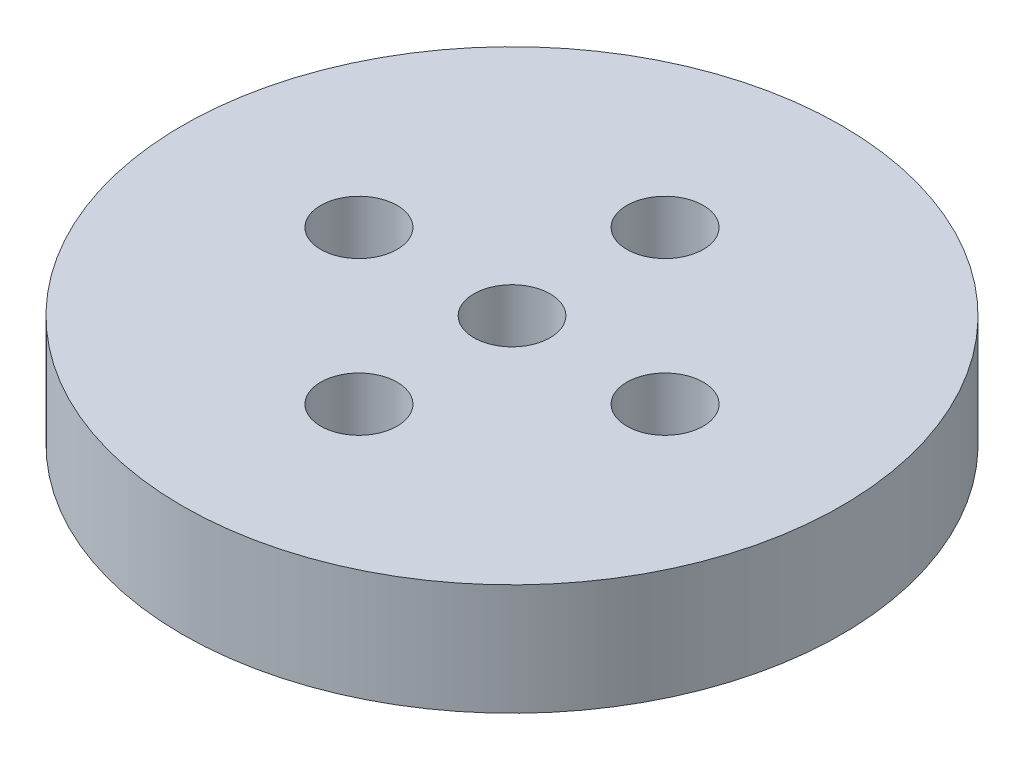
ISO-10303-21;
HEADER;
FILE_DESCRIPTION(('STEP AP214'),'2;1');
FILE_NAME('part.step','',(''),(''),'','','');
FILE_SCHEMA(('AUTOMOTIVE_DESIGN { 1 0 10303 214 1 1 1 1 }'));
ENDSEC;
DATA;
#1=APPLICATION_CONTEXT('core data for automotive mechanical design processes');
#2=APPLICATION_PROTOCOL_DEFINITION('international standard','automotive_design',2000,#1);
#3=PRODUCT_CONTEXT('',#1,'mechanical');
#4=PRODUCT('Part','Part','',(#3));
#5=PRODUCT_RELATED_PRODUCT_CATEGORY('part','',(#4));
#6=PRODUCT_DEFINITION_FORMATION('','',#4);
#7=PRODUCT_DEFINITION_CONTEXT('part definition',#1,'design');
#8=PRODUCT_DEFINITION('design','',#6,#7);
#9=PRODUCT_DEFINITION_SHAPE('','',#8);
#10=(LENGTH_UNIT() NAMED_UNIT(*) SI_UNIT(.MILLI.,.METRE.));
#11=(NAMED_UNIT(*) PLANE_ANGLE_UNIT() SI_UNIT($,.RADIAN.));
#12=(NAMED_UNIT(*) SI_UNIT($,.STERADIAN.) SOLID_ANGLE_UNIT());
#13=UNCERTAINTY_MEASURE_WITH_UNIT(LENGTH_MEASURE(1.E-05),#10,'distance_accuracy_value','');
#14=(GEOMETRIC_REPRESENTATION_CONTEXT(3) GLOBAL_UNCERTAINTY_ASSIGNED_CONTEXT((#13)) GLOBAL_UNIT_ASSIGNED_CONTEXT((#10,
#11,#12)) REPRESENTATION_CONTEXT('',''));
#15=CARTESIAN_POINT('',(0.,0.,0.));
#16=DIRECTION('',(0.,0.,1.));
#17=DIRECTION('',(1.,0.,0.));
#18=AXIS2_PLACEMENT_3D('',#15,#16,#17);
#19=CARTESIAN_POINT('',(0.,5.4,0.));
#20=DIRECTION('',(0.,1.,0.));
#21=DIRECTION('',(0.,0.,1.));
#22=AXIS2_PLACEMENT_3D('',#19,#20,#21);
#23=PLANE('',#22);
#24=CARTESIAN_POINT('',(-1.85110150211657E-13,5.4,7.43169227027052));
#25=DIRECTION('',(0.,1.,0.));
#26=DIRECTION('',(0.,0.,1.));
#27=AXIS2_PLACEMENT_3D('',#24,#25,#26);
#28=CIRCLE('',#27,1.855);
#29=CARTESIAN_POINT('',(-1.85110150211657E-13,5.4,5.57669227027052));
#30=VERTEX_POINT('',#29);
#31=EDGE_CURVE('E61',#30,#30,#28,.T.);
#32=ORIENTED_EDGE('',*,*,#31,.F.);
#33=EDGE_LOOP('',(#32));
#34=FACE_BOUND('',#33,.T.);
#35=CARTESIAN_POINT('',(0.,5.4,-7.43169227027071));
#36=DIRECTION('',(0.,1.,0.));
#37=DIRECTION('',(0.,0.,1.));
#38=AXIS2_PLACEMENT_3D('',#35,#36,#37);
#39=CIRCLE('',#38,1.855);
#40=CARTESIAN_POINT('',(0.,5.4,-9.28669227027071));
#41=VERTEX_POINT('',#40);
#42=EDGE_CURVE('E49',#41,#41,#39,.T.);
#43=ORIENTED_EDGE('',*,*,#42,.F.);
#44=EDGE_LOOP('',(#43));
#45=FACE_BOUND('',#44,.T.);
#46=CARTESIAN_POINT('',(0.,5.4,0.));
#47=DIRECTION('',(0.,1.,0.));
#48=DIRECTION('',(0.,0.,1.));
#49=AXIS2_PLACEMENT_3D('',#46,#47,#48);
#50=CIRCLE('',#49,16.);
#51=CARTESIAN_POINT('',(0.,5.4,-16.));
#52=VERTEX_POINT('',#51);
#53=EDGE_CURVE('E10',#52,#52,#50,.T.);
#54=ORIENTED_EDGE('',*,*,#53,.T.);
#55=EDGE_LOOP('',(#54));
#56=FACE_BOUND('',#55,.T.);
#57=CARTESIAN_POINT('',(0.,5.4,0.));
#58=DIRECTION('',(0.,1.,0.));
#59=DIRECTION('',(0.,0.,1.));
#60=AXIS2_PLACEMENT_3D('',#57,#58,#59);
#61=CIRCLE('',#60,1.85);
#62=CARTESIAN_POINT('',(0.,5.4,-1.85));
#63=VERTEX_POINT('',#62);
#64=EDGE_CURVE('E44',#63,#63,#61,.T.);
#65=ORIENTED_EDGE('',*,*,#64,.F.);
#66=EDGE_LOOP('',(#65));
#67=FACE_BOUND('',#66,.T.);
#68=CARTESIAN_POINT('',(7.43169227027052,5.4,0.));
#69=DIRECTION('',(0.,1.,0.));
#70=DIRECTION('',(0.,0.,1.));
#71=AXIS2_PLACEMENT_3D('',#68,#69,#70);
#72=CIRCLE('',#71,1.855);
#73=CARTESIAN_POINT('',(7.43169227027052,5.4,-1.855));
#74=VERTEX_POINT('',#73);
#75=EDGE_CURVE('E55',#74,#74,#72,.T.);
#76=ORIENTED_EDGE('',*,*,#75,.F.);
#77=EDGE_LOOP('',(#76));
#78=FACE_BOUND('',#77,.T.);
#79=CARTESIAN_POINT('',(-7.43169227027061,5.4,0.));
#80=DIRECTION('',(0.,1.,0.));
#81=DIRECTION('',(0.,0.,1.));
#82=AXIS2_PLACEMENT_3D('',#79,#80,#81);
#83=CIRCLE('',#82,1.85499999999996);
#84=CARTESIAN_POINT('',(-7.43169227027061,5.4,-1.85499999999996));
#85=VERTEX_POINT('',#84);
#86=EDGE_CURVE('E67',#85,#85,#83,.T.);
#87=ORIENTED_EDGE('',*,*,#86,.F.);
#88=EDGE_LOOP('',(#87));
#89=FACE_BOUND('',#88,.T.);
#90=ADVANCED_FACE('F33',(#34,#45,#56,#67,#78,#89),#23,.T.);
#91=CARTESIAN_POINT('',(0.,0.,0.));
#92=DIRECTION('',(0.,1.,0.));
#93=DIRECTION('',(0.,0.,1.));
#94=AXIS2_PLACEMENT_3D('',#91,#92,#93);
#95=PLANE('',#94);
#96=CARTESIAN_POINT('',(0.,0.,0.));
#97=DIRECTION('',(0.,1.,0.));
#98=DIRECTION('',(0.,0.,1.));
#99=AXIS2_PLACEMENT_3D('',#96,#97,#98);
#100=CIRCLE('',#99,16.);
#101=CARTESIAN_POINT('',(0.,0.,-16.));
#102=VERTEX_POINT('',#101);
#103=EDGE_CURVE('E37',#102,#102,#100,.T.);
#104=ORIENTED_EDGE('',*,*,#103,.F.);
#105=EDGE_LOOP('',(#104));
#106=FACE_BOUND('',#105,.T.);
#107=CARTESIAN_POINT('',(0.,0.,0.));
#108=DIRECTION('',(0.,1.,0.));
#109=DIRECTION('',(0.,0.,1.));
#110=AXIS2_PLACEMENT_3D('',#107,#108,#109);
#111=CIRCLE('',#110,1.85);
#112=CARTESIAN_POINT('',(0.,0.,-1.85));
#113=VERTEX_POINT('',#112);
#114=EDGE_CURVE('E46',#113,#113,#111,.T.);
#115=ORIENTED_EDGE('',*,*,#114,.T.);
#116=EDGE_LOOP('',(#115));
#117=FACE_BOUND('',#116,.T.);
#118=CARTESIAN_POINT('',(0.,0.,-7.43169227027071));
#119=DIRECTION('',(0.,1.,0.));
#120=DIRECTION('',(0.,0.,1.));
#121=AXIS2_PLACEMENT_3D('',#118,#119,#120);
#122=CIRCLE('',#121,1.855);
#123=CARTESIAN_POINT('',(0.,0.,-9.28669227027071));
#124=VERTEX_POINT('',#123);
#125=EDGE_CURVE('E52',#124,#124,#122,.T.);
#126=ORIENTED_EDGE('',*,*,#125,.T.);
#127=EDGE_LOOP('',(#126));
#128=FACE_BOUND('',#127,.T.);
#129=CARTESIAN_POINT('',(7.43169227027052,0.,0.));
#130=DIRECTION('',(0.,1.,0.));
#131=DIRECTION('',(0.,0.,1.));
#132=AXIS2_PLACEMENT_3D('',#129,#130,#131);
#133=CIRCLE('',#132,1.855);
#134=CARTESIAN_POINT('',(7.43169227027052,0.,-1.855));
#135=VERTEX_POINT('',#134);
#136=EDGE_CURVE('E58',#135,#135,#133,.T.);
#137=ORIENTED_EDGE('',*,*,#136,.T.);
#138=EDGE_LOOP('',(#137));
#139=FACE_BOUND('',#138,.T.);
#140=CARTESIAN_POINT('',(-1.85110150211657E-13,0.,7.43169227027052));
#141=DIRECTION('',(0.,1.,0.));
#142=DIRECTION('',(0.,0.,1.));
#143=AXIS2_PLACEMENT_3D('',#140,#141,#142);
#144=CIRCLE('',#143,1.855);
#145=CARTESIAN_POINT('',(-1.85110150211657E-13,0.,5.57669227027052));
#146=VERTEX_POINT('',#145);
#147=EDGE_CURVE('E64',#146,#146,#144,.T.);
#148=ORIENTED_EDGE('',*,*,#147,.T.);
#149=EDGE_LOOP('',(#148));
#150=FACE_BOUND('',#149,.T.);
#151=CARTESIAN_POINT('',(-7.43169227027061,0.,0.));
#152=DIRECTION('',(0.,1.,0.));
#153=DIRECTION('',(0.,0.,1.));
#154=AXIS2_PLACEMENT_3D('',#151,#152,#153);
#155=CIRCLE('',#154,1.85499999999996);
#156=CARTESIAN_POINT('',(-7.43169227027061,0.,-1.85499999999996));
#157=VERTEX_POINT('',#156);
#158=EDGE_CURVE('E70',#157,#157,#155,.T.);
#159=ORIENTED_EDGE('',*,*,#158,.T.);
#160=EDGE_LOOP('',(#159));
#161=FACE_BOUND('',#160,.T.);
#162=ADVANCED_FACE('F80',(#106,#117,#128,#139,#150,#161),#95,.F.);
#163=CARTESIAN_POINT('',(0.,5.4,0.));
#164=DIRECTION('',(0.,-1.,0.));
#165=DIRECTION('',(0.,0.,-1.));
#166=AXIS2_PLACEMENT_3D('',#163,#164,#165);
#167=CYLINDRICAL_SURFACE('',#166,16.);
#168=CARTESIAN_POINT('',(0.,5.4,-16.));
#169=CARTESIAN_POINT('',(0.,5.34375,-16.));
#170=CARTESIAN_POINT('',(0.,5.2875,-16.));
#171=CARTESIAN_POINT('',(0.,5.175,-16.));
#172=CARTESIAN_POINT('',(0.,5.11875,-16.));
#173=CARTESIAN_POINT('',(0.,5.00625,-16.));
#174=CARTESIAN_POINT('',(0.,4.95,-16.));
#175=CARTESIAN_POINT('',(0.,4.8375,-16.));
#176=CARTESIAN_POINT('',(0.,4.78125,-16.));
#177=CARTESIAN_POINT('',(0.,4.66875,-16.));
#178=CARTESIAN_POINT('',(0.,4.6125,-16.));
#179=CARTESIAN_POINT('',(0.,4.5,-16.));
#180=CARTESIAN_POINT('',(0.,4.44375,-16.));
#181=CARTESIAN_POINT('',(0.,4.33125,-16.));
#182=CARTESIAN_POINT('',(0.,4.275,-16.));
#183=CARTESIAN_POINT('',(0.,4.1625,-16.));
#184=CARTESIAN_POINT('',(0.,4.10625,-16.));
#185=CARTESIAN_POINT('',(0.,3.99375,-16.));
#186=CARTESIAN_POINT('',(0.,3.9375,-16.));
#187=CARTESIAN_POINT('',(0.,3.825,-16.));
#188=CARTESIAN_POINT('',(0.,3.76875,-16.));
#189=CARTESIAN_POINT('',(0.,3.65625,-16.));
#190=CARTESIAN_POINT('',(0.,3.6,-16.));
#191=CARTESIAN_POINT('',(0.,3.4875,-16.));
#192=CARTESIAN_POINT('',(0.,3.43125,-16.));
#193=CARTESIAN_POINT('',(0.,3.31875,-16.));
#194=CARTESIAN_POINT('',(0.,3.2625,-16.));
#195=CARTESIAN_POINT('',(0.,3.15,-16.));
#196=CARTESIAN_POINT('',(0.,3.09375,-16.));
#197=CARTESIAN_POINT('',(0.,2.98125,-16.));
#198=CARTESIAN_POINT('',(0.,2.925,-16.));
#199=CARTESIAN_POINT('',(0.,2.8125,-16.));
#200=CARTESIAN_POINT('',(0.,2.75625,-16.));
#201=CARTESIAN_POINT('',(0.,2.64375,-16.));
#202=CARTESIAN_POINT('',(0.,2.5875,-16.));
#203=CARTESIAN_POINT('',(0.,2.475,-16.));
#204=CARTESIAN_POINT('',(0.,2.41875,-16.));
#205=CARTESIAN_POINT('',(0.,2.30625,-16.));
#206=CARTESIAN_POINT('',(0.,2.25,-16.));
#207=CARTESIAN_POINT('',(0.,2.1375,-16.));
#208=CARTESIAN_POINT('',(0.,2.08125,-16.));
#209=CARTESIAN_POINT('',(0.,1.96875,-16.));
#210=CARTESIAN_POINT('',(0.,1.9125,-16.));
#211=CARTESIAN_POINT('',(0.,1.8,-16.));
#212=CARTESIAN_POINT('',(0.,1.74375,-16.));
#213=CARTESIAN_POINT('',(0.,1.63125,-16.));
#214=CARTESIAN_POINT('',(0.,1.575,-16.));
#215=CARTESIAN_POINT('',(0.,1.4625,-16.));
#216=CARTESIAN_POINT('',(0.,1.40625,-16.));
#217=CARTESIAN_POINT('',(0.,1.29375,-16.));
#218=CARTESIAN_POINT('',(0.,1.2375,-16.));
#219=CARTESIAN_POINT('',(0.,1.125,-16.));
#220=CARTESIAN_POINT('',(0.,1.06875,-16.));
#221=CARTESIAN_POINT('',(0.,0.956249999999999,-16.));
#222=CARTESIAN_POINT('',(0.,0.899999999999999,-16.));
#223=CARTESIAN_POINT('',(0.,0.787499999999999,-16.));
#224=CARTESIAN_POINT('',(0.,0.731249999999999,-16.));
#225=CARTESIAN_POINT('',(0.,0.618749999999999,-16.));
#226=CARTESIAN_POINT('',(0.,0.562499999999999,-16.));
#227=CARTESIAN_POINT('',(0.,0.449999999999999,-16.));
#228=CARTESIAN_POINT('',(0.,0.393749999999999,-16.));
#229=CARTESIAN_POINT('',(0.,0.281249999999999,-16.));
#230=CARTESIAN_POINT('',(0.,0.224999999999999,-16.));
#231=CARTESIAN_POINT('',(0.,0.112499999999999,-16.));
#232=CARTESIAN_POINT('',(0.,0.0562499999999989,-16.));
#233=CARTESIAN_POINT('',(0.,0.,-16.));
#234=B_SPLINE_CURVE_WITH_KNOTS('',3,(#168,#169,#170,#171,#172,#173,#174,#175,#176,#177,#178,
#179,#180,#181,#182,#183,#184,#185,#186,#187,#188,#189,#190,#191,#192,#193,#194,#195,#196,#197,
#198,#199,#200,#201,#202,#203,#204,#205,#206,#207,#208,#209,#210,#211,#212,#213,#214,#215,#216,
#217,#218,#219,#220,#221,#222,#223,#224,#225,#226,#227,#228,#229,#230,#231,#232,#233),
.UNSPECIFIED.,.F.,.F.,(4,2,2,2,2,2,2,2,2,2,2,2,2,2,2,2,2,2,2,2,2,2,2,2,2,2,2,2,2,2,2,2,4),(0.,
0.16875,0.337499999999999,0.50625,0.674999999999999,0.84375,1.0125,1.18125,1.35,1.51875,1.6875,
1.85625,2.025,2.19375,2.3625,2.53125,2.7,2.86875,3.0375,3.20625,3.375,3.54375,3.7125,3.88125,
4.05,4.21875,4.3875,4.55625,4.725,4.89375,5.0625,5.23125,5.4),.UNSPECIFIED.);
#235=EDGE_CURVE('BSEAM35',#52,#102,#234,.T.);
#236=ORIENTED_EDGE('',*,*,#53,.F.);
#237=ORIENTED_EDGE('',*,*,#103,.T.);
#238=ORIENTED_EDGE('',*,*,#235,.T.);
#239=ORIENTED_EDGE('',*,*,#235,.F.);
#240=EDGE_LOOP('',(#236,#238,#237,#239));
#241=FACE_BOUND('',#240,.T.);
#242=ADVANCED_FACE('F35',(#241),#167,.T.);
#243=CARTESIAN_POINT('',(0.,5.4,0.));
#244=DIRECTION('',(0.,-1.,0.));
#245=DIRECTION('',(0.,0.,-1.));
#246=AXIS2_PLACEMENT_3D('',#243,#244,#245);
#247=CYLINDRICAL_SURFACE('',#246,1.85);
#248=CARTESIAN_POINT('',(0.,5.4,-1.85));
#249=CARTESIAN_POINT('',(0.,5.34375,-1.85));
#250=CARTESIAN_POINT('',(0.,5.2875,-1.85));
#251=CARTESIAN_POINT('',(0.,5.175,-1.85));
#252=CARTESIAN_POINT('',(0.,5.11875,-1.85));
#253=CARTESIAN_POINT('',(0.,5.00625,-1.85));
#254=CARTESIAN_POINT('',(0.,4.95,-1.85));
#255=CARTESIAN_POINT('',(0.,4.8375,-1.85));
#256=CARTESIAN_POINT('',(0.,4.78125,-1.85));
#257=CARTESIAN_POINT('',(0.,4.66875,-1.85));
#258=CARTESIAN_POINT('',(0.,4.6125,-1.85));
#259=CARTESIAN_POINT('',(0.,4.5,-1.85));
#260=CARTESIAN_POINT('',(0.,4.44375,-1.85));
#261=CARTESIAN_POINT('',(0.,4.33125,-1.85));
#262=CARTESIAN_POINT('',(0.,4.275,-1.85));
#263=CARTESIAN_POINT('',(0.,4.1625,-1.85));
#264=CARTESIAN_POINT('',(0.,4.10625,-1.85));
#265=CARTESIAN_POINT('',(0.,3.99375,-1.85));
#266=CARTESIAN_POINT('',(0.,3.9375,-1.85));
#267=CARTESIAN_POINT('',(0.,3.825,-1.85));
#268=CARTESIAN_POINT('',(0.,3.76875,-1.85));
#269=CARTESIAN_POINT('',(0.,3.65625,-1.85));
#270=CARTESIAN_POINT('',(0.,3.6,-1.85));
#271=CARTESIAN_POINT('',(0.,3.4875,-1.85));
#272=CARTESIAN_POINT('',(0.,3.43125,-1.85));
#273=CARTESIAN_POINT('',(0.,3.31875,-1.85));
#274=CARTESIAN_POINT('',(0.,3.2625,-1.85));
#275=CARTESIAN_POINT('',(0.,3.15,-1.85));
#276=CARTESIAN_POINT('',(0.,3.09375,-1.85));
#277=CARTESIAN_POINT('',(0.,2.98125,-1.85));
#278=CARTESIAN_POINT('',(0.,2.925,-1.85));
#279=CARTESIAN_POINT('',(0.,2.8125,-1.85));
#280=CARTESIAN_POINT('',(0.,2.75625,-1.85));
#281=CARTESIAN_POINT('',(0.,2.64375,-1.85));
#282=CARTESIAN_POINT('',(0.,2.5875,-1.85));
#283=CARTESIAN_POINT('',(0.,2.475,-1.85));
#284=CARTESIAN_POINT('',(0.,2.41875,-1.85));
#285=CARTESIAN_POINT('',(0.,2.30625,-1.85));
#286=CARTESIAN_POINT('',(0.,2.25,-1.85));
#287=CARTESIAN_POINT('',(0.,2.1375,-1.85));
#288=CARTESIAN_POINT('',(0.,2.08125,-1.85));
#289=CARTESIAN_POINT('',(0.,1.96875,-1.85));
#290=CARTESIAN_POINT('',(0.,1.9125,-1.85));
#291=CARTESIAN_POINT('',(0.,1.8,-1.85));
#292=CARTESIAN_POINT('',(0.,1.74375,-1.85));
#293=CARTESIAN_POINT('',(0.,1.63125,-1.85));
#294=CARTESIAN_POINT('',(0.,1.575,-1.85));
#295=CARTESIAN_POINT('',(0.,1.4625,-1.85));
#296=CARTESIAN_POINT('',(0.,1.40625,-1.85));
#297=CARTESIAN_POINT('',(0.,1.29375,-1.85));
#298=CARTESIAN_POINT('',(0.,1.2375,-1.85));
#299=CARTESIAN_POINT('',(0.,1.125,-1.85));
#300=CARTESIAN_POINT('',(0.,1.06875,-1.85));
#301=CARTESIAN_POINT('',(0.,0.956249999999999,-1.85));
#302=CARTESIAN_POINT('',(0.,0.899999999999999,-1.85));
#303=CARTESIAN_POINT('',(0.,0.787499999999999,-1.85));
#304=CARTESIAN_POINT('',(0.,0.731249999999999,-1.85));
#305=CARTESIAN_POINT('',(0.,0.618749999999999,-1.85));
#306=CARTESIAN_POINT('',(0.,0.562499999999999,-1.85));
#307=CARTESIAN_POINT('',(0.,0.449999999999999,-1.85));
#308=CARTESIAN_POINT('',(0.,0.393749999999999,-1.85));
#309=CARTESIAN_POINT('',(0.,0.281249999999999,-1.85));
#310=CARTESIAN_POINT('',(0.,0.224999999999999,-1.85));
#311=CARTESIAN_POINT('',(0.,0.112499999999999,-1.85));
#312=CARTESIAN_POINT('',(0.,0.0562499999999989,-1.85));
#313=CARTESIAN_POINT('',(0.,0.,-1.85));
#314=B_SPLINE_CURVE_WITH_KNOTS('',3,(#248,#249,#250,#251,#252,#253,#254,#255,#256,#257,#258,
#259,#260,#261,#262,#263,#264,#265,#266,#267,#268,#269,#270,#271,#272,#273,#274,#275,#276,#277,
#278,#279,#280,#281,#282,#283,#284,#285,#286,#287,#288,#289,#290,#291,#292,#293,#294,#295,#296,
#297,#298,#299,#300,#301,#302,#303,#304,#305,#306,#307,#308,#309,#310,#311,#312,#313),
.UNSPECIFIED.,.F.,.F.,(4,2,2,2,2,2,2,2,2,2,2,2,2,2,2,2,2,2,2,2,2,2,2,2,2,2,2,2,2,2,2,2,4),(0.,
0.16875,0.337499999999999,0.50625,0.674999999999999,0.84375,1.0125,1.18125,1.35,1.51875,1.6875,
1.85625,2.025,2.19375,2.3625,2.53125,2.7,2.86875,3.0375,3.20625,3.375,3.54375,3.7125,3.88125,
4.05,4.21875,4.3875,4.55625,4.725,4.89375,5.0625,5.23125,5.4),.UNSPECIFIED.);
#315=EDGE_CURVE('BSEAM90',#63,#113,#314,.T.);
#316=ORIENTED_EDGE('',*,*,#64,.T.);
#317=ORIENTED_EDGE('',*,*,#114,.F.);
#318=ORIENTED_EDGE('',*,*,#315,.T.);
#319=ORIENTED_EDGE('',*,*,#315,.F.);
#320=EDGE_LOOP('',(#316,#318,#317,#319));
#321=FACE_BOUND('',#320,.T.);
#322=ADVANCED_FACE('F90',(#321),#247,.F.);
#323=CARTESIAN_POINT('',(0.,5.4,-7.43169227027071));
#324=DIRECTION('',(0.,-1.,0.));
#325=DIRECTION('',(0.,0.,-1.));
#326=AXIS2_PLACEMENT_3D('',#323,#324,#325);
#327=CYLINDRICAL_SURFACE('',#326,1.855);
#328=CARTESIAN_POINT('',(0.,5.4,-9.28669227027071));
#329=CARTESIAN_POINT('',(0.,5.34375,-9.28669227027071));
#330=CARTESIAN_POINT('',(0.,5.2875,-9.28669227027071));
#331=CARTESIAN_POINT('',(0.,5.175,-9.28669227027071));
#332=CARTESIAN_POINT('',(0.,5.11875,-9.28669227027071));
#333=CARTESIAN_POINT('',(0.,5.00625,-9.28669227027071));
#334=CARTESIAN_POINT('',(0.,4.95,-9.28669227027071));
#335=CARTESIAN_POINT('',(0.,4.8375,-9.28669227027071));
#336=CARTESIAN_POINT('',(0.,4.78125,-9.28669227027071));
#337=CARTESIAN_POINT('',(0.,4.66875,-9.28669227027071));
#338=CARTESIAN_POINT('',(0.,4.6125,-9.28669227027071));
#339=CARTESIAN_POINT('',(0.,4.5,-9.28669227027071));
#340=CARTESIAN_POINT('',(0.,4.44375,-9.28669227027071));
#341=CARTESIAN_POINT('',(0.,4.33125,-9.28669227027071));
#342=CARTESIAN_POINT('',(0.,4.275,-9.28669227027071));
#343=CARTESIAN_POINT('',(0.,4.1625,-9.28669227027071));
#344=CARTESIAN_POINT('',(0.,4.10625,-9.28669227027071));
#345=CARTESIAN_POINT('',(0.,3.99375,-9.28669227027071));
#346=CARTESIAN_POINT('',(0.,3.9375,-9.28669227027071));
#347=CARTESIAN_POINT('',(0.,3.825,-9.28669227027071));
#348=CARTESIAN_POINT('',(0.,3.76875,-9.28669227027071));
#349=CARTESIAN_POINT('',(0.,3.65625,-9.28669227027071));
#350=CARTESIAN_POINT('',(0.,3.6,-9.28669227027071));
#351=CARTESIAN_POINT('',(0.,3.4875,-9.28669227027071));
#352=CARTESIAN_POINT('',(0.,3.43125,-9.28669227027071));
#353=CARTESIAN_POINT('',(0.,3.31875,-9.28669227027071));
#354=CARTESIAN_POINT('',(0.,3.2625,-9.28669227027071));
#355=CARTESIAN_POINT('',(0.,3.15,-9.28669227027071));
#356=CARTESIAN_POINT('',(0.,3.09375,-9.28669227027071));
#357=CARTESIAN_POINT('',(0.,2.98125,-9.28669227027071));
#358=CARTESIAN_POINT('',(0.,2.925,-9.28669227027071));
#359=CARTESIAN_POINT('',(0.,2.8125,-9.28669227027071));
#360=CARTESIAN_POINT('',(0.,2.75625,-9.28669227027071));
#361=CARTESIAN_POINT('',(0.,2.64375,-9.28669227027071));
#362=CARTESIAN_POINT('',(0.,2.5875,-9.28669227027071));
#363=CARTESIAN_POINT('',(0.,2.475,-9.28669227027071));
#364=CARTESIAN_POINT('',(0.,2.41875,-9.28669227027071));
#365=CARTESIAN_POINT('',(0.,2.30625,-9.28669227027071));
#366=CARTESIAN_POINT('',(0.,2.25,-9.28669227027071));
#367=CARTESIAN_POINT('',(0.,2.1375,-9.28669227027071));
#368=CARTESIAN_POINT('',(0.,2.08125,-9.28669227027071));
#369=CARTESIAN_POINT('',(0.,1.96875,-9.28669227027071));
#370=CARTESIAN_POINT('',(0.,1.9125,-9.28669227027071));
#371=CARTESIAN_POINT('',(0.,1.8,-9.28669227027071));
#372=CARTESIAN_POINT('',(0.,1.74375,-9.28669227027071));
#373=CARTESIAN_POINT('',(0.,1.63125,-9.28669227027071));
#374=CARTESIAN_POINT('',(0.,1.575,-9.28669227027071));
#375=CARTESIAN_POINT('',(0.,1.4625,-9.28669227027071));
#376=CARTESIAN_POINT('',(0.,1.40625,-9.28669227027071));
#377=CARTESIAN_POINT('',(0.,1.29375,-9.28669227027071));
#378=CARTESIAN_POINT('',(0.,1.2375,-9.28669227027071));
#379=CARTESIAN_POINT('',(0.,1.125,-9.28669227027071));
#380=CARTESIAN_POINT('',(0.,1.06875,-9.28669227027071));
#381=CARTESIAN_POINT('',(0.,0.95625,-9.28669227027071));
#382=CARTESIAN_POINT('',(0.,0.9,-9.28669227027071));
#383=CARTESIAN_POINT('',(0.,0.7875,-9.28669227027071));
#384=CARTESIAN_POINT('',(0.,0.73125,-9.28669227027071));
#385=CARTESIAN_POINT('',(0.,0.618749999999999,-9.28669227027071));
#386=CARTESIAN_POINT('',(0.,0.562499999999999,-9.28669227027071));
#387=CARTESIAN_POINT('',(0.,0.449999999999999,-9.28669227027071));
#388=CARTESIAN_POINT('',(0.,0.393749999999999,-9.28669227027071));
#389=CARTESIAN_POINT('',(0.,0.281249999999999,-9.28669227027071));
#390=CARTESIAN_POINT('',(0.,0.225,-9.28669227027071));
#391=CARTESIAN_POINT('',(0.,0.112499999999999,-9.28669227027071));
#392=CARTESIAN_POINT('',(0.,0.0562499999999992,-9.28669227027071));
#393=CARTESIAN_POINT('',(0.,0.,-9.28669227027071));
#394=B_SPLINE_CURVE_WITH_KNOTS('',3,(#328,#329,#330,#331,#332,#333,#334,#335,#336,#337,#338,
#339,#340,#341,#342,#343,#344,#345,#346,#347,#348,#349,#350,#351,#352,#353,#354,#355,#356,#357,
#358,#359,#360,#361,#362,#363,#364,#365,#366,#367,#368,#369,#370,#371,#372,#373,#374,#375,#376,
#377,#378,#379,#380,#381,#382,#383,#384,#385,#386,#387,#388,#389,#390,#391,#392,#393),
.UNSPECIFIED.,.F.,.F.,(4,2,2,2,2,2,2,2,2,2,2,2,2,2,2,2,2,2,2,2,2,2,2,2,2,2,2,2,2,2,2,2,4),(0.,
0.168750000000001,0.3375,0.506250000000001,0.675,0.843750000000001,1.0125,1.18125,1.35,1.51875,
1.6875,1.85625,2.025,2.19375,2.3625,2.53125,2.7,2.86875,3.0375,3.20625,3.375,3.54375,3.7125,
3.88125,4.05,4.21875,4.3875,4.55625,4.725,4.89375,5.0625,5.23125,5.4),.UNSPECIFIED.);
#395=EDGE_CURVE('BSEAM93',#41,#124,#394,.T.);
#396=ORIENTED_EDGE('',*,*,#42,.T.);
#397=ORIENTED_EDGE('',*,*,#125,.F.);
#398=ORIENTED_EDGE('',*,*,#395,.T.);
#399=ORIENTED_EDGE('',*,*,#395,.F.);
#400=EDGE_LOOP('',(#396,#398,#397,#399));
#401=FACE_BOUND('',#400,.T.);
#402=ADVANCED_FACE('F93',(#401),#327,.F.);
#403=CARTESIAN_POINT('',(7.43169227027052,5.4,0.));
#404=DIRECTION('',(0.,-1.,0.));
#405=DIRECTION('',(0.,0.,-1.));
#406=AXIS2_PLACEMENT_3D('',#403,#404,#405);
#407=CYLINDRICAL_SURFACE('',#406,1.855);
#408=CARTESIAN_POINT('',(7.43169227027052,5.4,-1.855));
#409=CARTESIAN_POINT('',(7.43169227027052,5.34375,-1.855));
#410=CARTESIAN_POINT('',(7.43169227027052,5.2875,-1.855));
#411=CARTESIAN_POINT('',(7.43169227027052,5.175,-1.855));
#412=CARTESIAN_POINT('',(7.43169227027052,5.11875,-1.855));
#413=CARTESIAN_POINT('',(7.43169227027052,5.00625,-1.855));
#414=CARTESIAN_POINT('',(7.43169227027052,4.95,-1.855));
#415=CARTESIAN_POINT('',(7.43169227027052,4.8375,-1.855));
#416=CARTESIAN_POINT('',(7.43169227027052,4.78125,-1.855));
#417=CARTESIAN_POINT('',(7.43169227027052,4.66875,-1.855));
#418=CARTESIAN_POINT('',(7.43169227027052,4.6125,-1.855));
#419=CARTESIAN_POINT('',(7.43169227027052,4.5,-1.855));
#420=CARTESIAN_POINT('',(7.43169227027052,4.44375,-1.855));
#421=CARTESIAN_POINT('',(7.43169227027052,4.33125,-1.855));
#422=CARTESIAN_POINT('',(7.43169227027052,4.275,-1.855));
#423=CARTESIAN_POINT('',(7.43169227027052,4.1625,-1.855));
#424=CARTESIAN_POINT('',(7.43169227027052,4.10625,-1.855));
#425=CARTESIAN_POINT('',(7.43169227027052,3.99375,-1.855));
#426=CARTESIAN_POINT('',(7.43169227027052,3.9375,-1.855));
#427=CARTESIAN_POINT('',(7.43169227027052,3.825,-1.855));
#428=CARTESIAN_POINT('',(7.43169227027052,3.76875,-1.855));
#429=CARTESIAN_POINT('',(7.43169227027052,3.65625,-1.855));
#430=CARTESIAN_POINT('',(7.43169227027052,3.6,-1.855));
#431=CARTESIAN_POINT('',(7.43169227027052,3.4875,-1.855));
#432=CARTESIAN_POINT('',(7.43169227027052,3.43125,-1.855));
#433=CARTESIAN_POINT('',(7.43169227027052,3.31875,-1.855));
#434=CARTESIAN_POINT('',(7.43169227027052,3.2625,-1.855));
#435=CARTESIAN_POINT('',(7.43169227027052,3.15,-1.855));
#436=CARTESIAN_POINT('',(7.43169227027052,3.09375,-1.855));
#437=CARTESIAN_POINT('',(7.43169227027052,2.98125,-1.855));
#438=CARTESIAN_POINT('',(7.43169227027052,2.925,-1.855));
#439=CARTESIAN_POINT('',(7.43169227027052,2.8125,-1.855));
#440=CARTESIAN_POINT('',(7.43169227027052,2.75625,-1.855));
#441=CARTESIAN_POINT('',(7.43169227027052,2.64375,-1.855));
#442=CARTESIAN_POINT('',(7.43169227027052,2.5875,-1.855));
#443=CARTESIAN_POINT('',(7.43169227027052,2.475,-1.855));
#444=CARTESIAN_POINT('',(7.43169227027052,2.41875,-1.855));
#445=CARTESIAN_POINT('',(7.43169227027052,2.30625,-1.855));
#446=CARTESIAN_POINT('',(7.43169227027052,2.25,-1.855));
#447=CARTESIAN_POINT('',(7.43169227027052,2.1375,-1.855));
#448=CARTESIAN_POINT('',(7.43169227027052,2.08125,-1.855));
#449=CARTESIAN_POINT('',(7.43169227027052,1.96875,-1.855));
#450=CARTESIAN_POINT('',(7.43169227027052,1.9125,-1.855));
#451=CARTESIAN_POINT('',(7.43169227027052,1.8,-1.855));
#452=CARTESIAN_POINT('',(7.43169227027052,1.74375,-1.855));
#453=CARTESIAN_POINT('',(7.43169227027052,1.63125,-1.855));
#454=CARTESIAN_POINT('',(7.43169227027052,1.575,-1.855));
#455=CARTESIAN_POINT('',(7.43169227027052,1.4625,-1.855));
#456=CARTESIAN_POINT('',(7.43169227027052,1.40625,-1.855));
#457=CARTESIAN_POINT('',(7.43169227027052,1.29375,-1.855));
#458=CARTESIAN_POINT('',(7.43169227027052,1.2375,-1.855));
#459=CARTESIAN_POINT('',(7.43169227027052,1.125,-1.855));
#460=CARTESIAN_POINT('',(7.43169227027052,1.06875,-1.855));
#461=CARTESIAN_POINT('',(7.43169227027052,0.95625,-1.855));
#462=CARTESIAN_POINT('',(7.43169227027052,0.9,-1.855));
#463=CARTESIAN_POINT('',(7.43169227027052,0.7875,-1.855));
#464=CARTESIAN_POINT('',(7.43169227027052,0.73125,-1.855));
#465=CARTESIAN_POINT('',(7.43169227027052,0.618749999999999,-1.855));
#466=CARTESIAN_POINT('',(7.43169227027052,0.562499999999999,-1.855));
#467=CARTESIAN_POINT('',(7.43169227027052,0.449999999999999,-1.855));
#468=CARTESIAN_POINT('',(7.43169227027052,0.393749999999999,-1.855));
#469=CARTESIAN_POINT('',(7.43169227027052,0.281249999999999,-1.855));
#470=CARTESIAN_POINT('',(7.43169227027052,0.225,-1.855));
#471=CARTESIAN_POINT('',(7.43169227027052,0.112499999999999,-1.855));
#472=CARTESIAN_POINT('',(7.43169227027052,0.0562499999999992,-1.855));
#473=CARTESIAN_POINT('',(7.43169227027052,0.,-1.855));
#474=B_SPLINE_CURVE_WITH_KNOTS('',3,(#408,#409,#410,#411,#412,#413,#414,#415,#416,#417,#418,
#419,#420,#421,#422,#423,#424,#425,#426,#427,#428,#429,#430,#431,#432,#433,#434,#435,#436,#437,
#438,#439,#440,#441,#442,#443,#444,#445,#446,#447,#448,#449,#450,#451,#452,#453,#454,#455,#456,
#457,#458,#459,#460,#461,#462,#463,#464,#465,#466,#467,#468,#469,#470,#471,#472,#473),
.UNSPECIFIED.,.F.,.F.,(4,2,2,2,2,2,2,2,2,2,2,2,2,2,2,2,2,2,2,2,2,2,2,2,2,2,2,2,2,2,2,2,4),(0.,
0.168750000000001,0.3375,0.506250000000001,0.675,0.843750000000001,1.0125,1.18125,1.35,1.51875,
1.6875,1.85625,2.025,2.19375,2.3625,2.53125,2.7,2.86875,3.0375,3.20625,3.375,3.54375,3.7125,
3.88125,4.05,4.21875,4.3875,4.55625,4.725,4.89375,5.0625,5.23125,5.4),.UNSPECIFIED.);
#475=EDGE_CURVE('BSEAM97',#74,#135,#474,.T.);
#476=ORIENTED_EDGE('',*,*,#75,.T.);
#477=ORIENTED_EDGE('',*,*,#136,.F.);
#478=ORIENTED_EDGE('',*,*,#475,.T.);
#479=ORIENTED_EDGE('',*,*,#475,.F.);
#480=EDGE_LOOP('',(#476,#478,#477,#479));
#481=FACE_BOUND('',#480,.T.);
#482=ADVANCED_FACE('F97',(#481),#407,.F.);
#483=CARTESIAN_POINT('',(-1.85110150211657E-13,5.4,7.43169227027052));
#484=DIRECTION('',(0.,-1.,0.));
#485=DIRECTION('',(0.,0.,-1.));
#486=AXIS2_PLACEMENT_3D('',#483,#484,#485);
#487=CYLINDRICAL_SURFACE('',#486,1.855);
#488=CARTESIAN_POINT('',(-1.85110150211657E-13,5.4,5.57669227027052));
#489=CARTESIAN_POINT('',(-1.85110150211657E-13,5.34375,5.57669227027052));
#490=CARTESIAN_POINT('',(-1.85110150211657E-13,5.2875,5.57669227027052));
#491=CARTESIAN_POINT('',(-1.85110150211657E-13,5.175,5.57669227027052));
#492=CARTESIAN_POINT('',(-1.85110150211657E-13,5.11875,5.57669227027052));
#493=CARTESIAN_POINT('',(-1.85110150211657E-13,5.00625,5.57669227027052));
#494=CARTESIAN_POINT('',(-1.85110150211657E-13,4.95,5.57669227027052));
#495=CARTESIAN_POINT('',(-1.85110150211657E-13,4.8375,5.57669227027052));
#496=CARTESIAN_POINT('',(-1.85110150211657E-13,4.78125,5.57669227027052));
#497=CARTESIAN_POINT('',(-1.85110150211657E-13,4.66875,5.57669227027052));
#498=CARTESIAN_POINT('',(-1.85110150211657E-13,4.6125,5.57669227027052));
#499=CARTESIAN_POINT('',(-1.85110150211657E-13,4.5,5.57669227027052));
#500=CARTESIAN_POINT('',(-1.85110150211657E-13,4.44375,5.57669227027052));
#501=CARTESIAN_POINT('',(-1.85110150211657E-13,4.33125,5.57669227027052));
#502=CARTESIAN_POINT('',(-1.85110150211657E-13,4.275,5.57669227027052));
#503=CARTESIAN_POINT('',(-1.85110150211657E-13,4.1625,5.57669227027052));
#504=CARTESIAN_POINT('',(-1.85110150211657E-13,4.10625,5.57669227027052));
#505=CARTESIAN_POINT('',(-1.85110150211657E-13,3.99375,5.57669227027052));
#506=CARTESIAN_POINT('',(-1.85110150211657E-13,3.9375,5.57669227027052));
#507=CARTESIAN_POINT('',(-1.85110150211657E-13,3.825,5.57669227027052));
#508=CARTESIAN_POINT('',(-1.85110150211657E-13,3.76875,5.57669227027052));
#509=CARTESIAN_POINT('',(-1.85110150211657E-13,3.65625,5.57669227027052));
#510=CARTESIAN_POINT('',(-1.85110150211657E-13,3.6,5.57669227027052));
#511=CARTESIAN_POINT('',(-1.85110150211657E-13,3.4875,5.57669227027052));
#512=CARTESIAN_POINT('',(-1.85110150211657E-13,3.43125,5.57669227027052));
#513=CARTESIAN_POINT('',(-1.85110150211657E-13,3.31875,5.57669227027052));
#514=CARTESIAN_POINT('',(-1.85110150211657E-13,3.2625,5.57669227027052));
#515=CARTESIAN_POINT('',(-1.85110150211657E-13,3.15,5.57669227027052));
#516=CARTESIAN_POINT('',(-1.85110150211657E-13,3.09375,5.57669227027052));
#517=CARTESIAN_POINT('',(-1.85110150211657E-13,2.98125,5.57669227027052));
#518=CARTESIAN_POINT('',(-1.85110150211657E-13,2.925,5.57669227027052));
#519=CARTESIAN_POINT('',(-1.85110150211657E-13,2.8125,5.57669227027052));
#520=CARTESIAN_POINT('',(-1.85110150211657E-13,2.75625,5.57669227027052));
#521=CARTESIAN_POINT('',(-1.85110150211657E-13,2.64375,5.57669227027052));
#522=CARTESIAN_POINT('',(-1.85110150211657E-13,2.5875,5.57669227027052));
#523=CARTESIAN_POINT('',(-1.85110150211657E-13,2.475,5.57669227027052));
#524=CARTESIAN_POINT('',(-1.85110150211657E-13,2.41875,5.57669227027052));
#525=CARTESIAN_POINT('',(-1.85110150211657E-13,2.30625,5.57669227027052));
#526=CARTESIAN_POINT('',(-1.85110150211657E-13,2.25,5.57669227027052));
#527=CARTESIAN_POINT('',(-1.85110150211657E-13,2.1375,5.57669227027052));
#528=CARTESIAN_POINT('',(-1.85110150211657E-13,2.08125,5.57669227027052));
#529=CARTESIAN_POINT('',(-1.85110150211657E-13,1.96875,5.57669227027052));
#530=CARTESIAN_POINT('',(-1.85110150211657E-13,1.9125,5.57669227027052));
#531=CARTESIAN_POINT('',(-1.85110150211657E-13,1.8,5.57669227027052));
#532=CARTESIAN_POINT('',(-1.85110150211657E-13,1.74375,5.57669227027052));
#533=CARTESIAN_POINT('',(-1.85110150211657E-13,1.63125,5.57669227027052));
#534=CARTESIAN_POINT('',(-1.85110150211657E-13,1.575,5.57669227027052));
#535=CARTESIAN_POINT('',(-1.85110150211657E-13,1.4625,5.57669227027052));
#536=CARTESIAN_POINT('',(-1.85110150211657E-13,1.40625,5.57669227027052));
#537=CARTESIAN_POINT('',(-1.85110150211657E-13,1.29375,5.57669227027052));
#538=CARTESIAN_POINT('',(-1.85110150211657E-13,1.2375,5.57669227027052));
#539=CARTESIAN_POINT('',(-1.85110150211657E-13,1.125,5.57669227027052));
#540=CARTESIAN_POINT('',(-1.85110150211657E-13,1.06875,5.57669227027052));
#541=CARTESIAN_POINT('',(-1.85110150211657E-13,0.95625,5.57669227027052));
#542=CARTESIAN_POINT('',(-1.85110150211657E-13,0.9,5.57669227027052));
#543=CARTESIAN_POINT('',(-1.85110150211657E-13,0.7875,5.57669227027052));
#544=CARTESIAN_POINT('',(-1.85110150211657E-13,0.73125,5.57669227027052));
#545=CARTESIAN_POINT('',(-1.85110150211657E-13,0.618749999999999,5.57669227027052));
#546=CARTESIAN_POINT('',(-1.85110150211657E-13,0.562499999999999,5.57669227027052));
#547=CARTESIAN_POINT('',(-1.85110150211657E-13,0.449999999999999,5.57669227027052));
#548=CARTESIAN_POINT('',(-1.85110150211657E-13,0.393749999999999,5.57669227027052));
#549=CARTESIAN_POINT('',(-1.85110150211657E-13,0.281249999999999,5.57669227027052));
#550=CARTESIAN_POINT('',(-1.85110150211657E-13,0.225,5.57669227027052));
#551=CARTESIAN_POINT('',(-1.85110150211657E-13,0.112499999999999,5.57669227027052));
#552=CARTESIAN_POINT('',(-1.85110150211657E-13,0.0562499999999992,5.57669227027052));
#553=CARTESIAN_POINT('',(-1.85110150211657E-13,0.,5.57669227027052));
#554=B_SPLINE_CURVE_WITH_KNOTS('',3,(#488,#489,#490,#491,#492,#493,#494,#495,#496,#497,#498,
#499,#500,#501,#502,#503,#504,#505,#506,#507,#508,#509,#510,#511,#512,#513,#514,#515,#516,#517,
#518,#519,#520,#521,#522,#523,#524,#525,#526,#527,#528,#529,#530,#531,#532,#533,#534,#535,#536,
#537,#538,#539,#540,#541,#542,#543,#544,#545,#546,#547,#548,#549,#550,#551,#552,#553),
.UNSPECIFIED.,.F.,.F.,(4,2,2,2,2,2,2,2,2,2,2,2,2,2,2,2,2,2,2,2,2,2,2,2,2,2,2,2,2,2,2,2,4),(0.,
0.168750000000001,0.3375,0.506250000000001,0.675,0.843750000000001,1.0125,1.18125,1.35,1.51875,
1.6875,1.85625,2.025,2.19375,2.3625,2.53125,2.7,2.86875,3.0375,3.20625,3.375,3.54375,3.7125,
3.88125,4.05,4.21875,4.3875,4.55625,4.725,4.89375,5.0625,5.23125,5.4),.UNSPECIFIED.);
#555=EDGE_CURVE('BSEAM101',#30,#146,#554,.T.);
#556=ORIENTED_EDGE('',*,*,#31,.T.);
#557=ORIENTED_EDGE('',*,*,#147,.F.);
#558=ORIENTED_EDGE('',*,*,#555,.T.);
#559=ORIENTED_EDGE('',*,*,#555,.F.);
#560=EDGE_LOOP('',(#556,#558,#557,#559));
#561=FACE_BOUND('',#560,.T.);
#562=ADVANCED_FACE('F101',(#561),#487,.F.);
#563=CARTESIAN_POINT('',(-7.43169227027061,5.4,0.));
#564=DIRECTION('',(0.,-1.,0.));
#565=DIRECTION('',(0.,0.,-1.));
#566=AXIS2_PLACEMENT_3D('',#563,#564,#565);
#567=CYLINDRICAL_SURFACE('',#566,1.85499999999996);
#568=CARTESIAN_POINT('',(-7.43169227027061,5.4,-1.85499999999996));
#569=CARTESIAN_POINT('',(-7.43169227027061,5.34375,-1.85499999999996));
#570=CARTESIAN_POINT('',(-7.43169227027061,5.2875,-1.85499999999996));
#571=CARTESIAN_POINT('',(-7.43169227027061,5.175,-1.85499999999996));
#572=CARTESIAN_POINT('',(-7.43169227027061,5.11875,-1.85499999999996));
#573=CARTESIAN_POINT('',(-7.43169227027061,5.00625,-1.85499999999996));
#574=CARTESIAN_POINT('',(-7.43169227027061,4.95,-1.85499999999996));
#575=CARTESIAN_POINT('',(-7.43169227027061,4.8375,-1.85499999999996));
#576=CARTESIAN_POINT('',(-7.43169227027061,4.78125,-1.85499999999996));
#577=CARTESIAN_POINT('',(-7.43169227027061,4.66875,-1.85499999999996));
#578=CARTESIAN_POINT('',(-7.43169227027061,4.6125,-1.85499999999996));
#579=CARTESIAN_POINT('',(-7.43169227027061,4.5,-1.85499999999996));
#580=CARTESIAN_POINT('',(-7.43169227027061,4.44375,-1.85499999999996));
#581=CARTESIAN_POINT('',(-7.43169227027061,4.33125,-1.85499999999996));
#582=CARTESIAN_POINT('',(-7.43169227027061,4.275,-1.85499999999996));
#583=CARTESIAN_POINT('',(-7.43169227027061,4.1625,-1.85499999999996));
#584=CARTESIAN_POINT('',(-7.43169227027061,4.10625,-1.85499999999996));
#585=CARTESIAN_POINT('',(-7.43169227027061,3.99375,-1.85499999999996));
#586=CARTESIAN_POINT('',(-7.43169227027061,3.9375,-1.85499999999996));
#587=CARTESIAN_POINT('',(-7.43169227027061,3.825,-1.85499999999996));
#588=CARTESIAN_POINT('',(-7.43169227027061,3.76875,-1.85499999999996));
#589=CARTESIAN_POINT('',(-7.43169227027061,3.65625,-1.85499999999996));
#590=CARTESIAN_POINT('',(-7.43169227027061,3.6,-1.85499999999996));
#591=CARTESIAN_POINT('',(-7.43169227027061,3.4875,-1.85499999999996));
#592=CARTESIAN_POINT('',(-7.43169227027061,3.43125,-1.85499999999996));
#593=CARTESIAN_POINT('',(-7.43169227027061,3.31875,-1.85499999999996));
#594=CARTESIAN_POINT('',(-7.43169227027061,3.2625,-1.85499999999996));
#595=CARTESIAN_POINT('',(-7.43169227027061,3.15,-1.85499999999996));
#596=CARTESIAN_POINT('',(-7.43169227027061,3.09375,-1.85499999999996));
#597=CARTESIAN_POINT('',(-7.43169227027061,2.98125,-1.85499999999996));
#598=CARTESIAN_POINT('',(-7.43169227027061,2.925,-1.85499999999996));
#599=CARTESIAN_POINT('',(-7.43169227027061,2.8125,-1.85499999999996));
#600=CARTESIAN_POINT('',(-7.43169227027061,2.75625,-1.85499999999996));
#601=CARTESIAN_POINT('',(-7.43169227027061,2.64375,-1.85499999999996));
#602=CARTESIAN_POINT('',(-7.43169227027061,2.5875,-1.85499999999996));
#603=CARTESIAN_POINT('',(-7.43169227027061,2.475,-1.85499999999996));
#604=CARTESIAN_POINT('',(-7.43169227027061,2.41875,-1.85499999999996));
#605=CARTESIAN_POINT('',(-7.43169227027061,2.30625,-1.85499999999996));
#606=CARTESIAN_POINT('',(-7.43169227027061,2.25,-1.85499999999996));
#607=CARTESIAN_POINT('',(-7.43169227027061,2.1375,-1.85499999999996));
#608=CARTESIAN_POINT('',(-7.43169227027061,2.08125,-1.85499999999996));
#609=CARTESIAN_POINT('',(-7.43169227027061,1.96875,-1.85499999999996));
#610=CARTESIAN_POINT('',(-7.43169227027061,1.9125,-1.85499999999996));
#611=CARTESIAN_POINT('',(-7.43169227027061,1.8,-1.85499999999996));
#612=CARTESIAN_POINT('',(-7.43169227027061,1.74375,-1.85499999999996));
#613=CARTESIAN_POINT('',(-7.43169227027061,1.63125,-1.85499999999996));
#614=CARTESIAN_POINT('',(-7.43169227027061,1.575,-1.85499999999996));
#615=CARTESIAN_POINT('',(-7.43169227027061,1.4625,-1.85499999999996));
#616=CARTESIAN_POINT('',(-7.43169227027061,1.40625,-1.85499999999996));
#617=CARTESIAN_POINT('',(-7.43169227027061,1.29375,-1.85499999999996));
#618=CARTESIAN_POINT('',(-7.43169227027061,1.2375,-1.85499999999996));
#619=CARTESIAN_POINT('',(-7.43169227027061,1.125,-1.85499999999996));
#620=CARTESIAN_POINT('',(-7.43169227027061,1.06875,-1.85499999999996));
#621=CARTESIAN_POINT('',(-7.43169227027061,0.95625,-1.85499999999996));
#622=CARTESIAN_POINT('',(-7.43169227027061,0.9,-1.85499999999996));
#623=CARTESIAN_POINT('',(-7.43169227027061,0.7875,-1.85499999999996));
#624=CARTESIAN_POINT('',(-7.43169227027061,0.73125,-1.85499999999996));
#625=CARTESIAN_POINT('',(-7.43169227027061,0.618749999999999,-1.85499999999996));
#626=CARTESIAN_POINT('',(-7.43169227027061,0.562499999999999,-1.85499999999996));
#627=CARTESIAN_POINT('',(-7.43169227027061,0.449999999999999,-1.85499999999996));
#628=CARTESIAN_POINT('',(-7.43169227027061,0.393749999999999,-1.85499999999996));
#629=CARTESIAN_POINT('',(-7.43169227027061,0.281249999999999,-1.85499999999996));
#630=CARTESIAN_POINT('',(-7.43169227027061,0.225,-1.85499999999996));
#631=CARTESIAN_POINT('',(-7.43169227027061,0.112499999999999,-1.85499999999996));
#632=CARTESIAN_POINT('',(-7.43169227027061,0.0562499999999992,-1.85499999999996));
#633=CARTESIAN_POINT('',(-7.43169227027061,0.,-1.85499999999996));
#634=B_SPLINE_CURVE_WITH_KNOTS('',3,(#568,#569,#570,#571,#572,#573,#574,#575,#576,#577,#578,
#579,#580,#581,#582,#583,#584,#585,#586,#587,#588,#589,#590,#591,#592,#593,#594,#595,#596,#597,
#598,#599,#600,#601,#602,#603,#604,#605,#606,#607,#608,#609,#610,#611,#612,#613,#614,#615,#616,
#617,#618,#619,#620,#621,#622,#623,#624,#625,#626,#627,#628,#629,#630,#631,#632,#633),
.UNSPECIFIED.,.F.,.F.,(4,2,2,2,2,2,2,2,2,2,2,2,2,2,2,2,2,2,2,2,2,2,2,2,2,2,2,2,2,2,2,2,4),(0.,
0.168750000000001,0.3375,0.506250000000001,0.675,0.843750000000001,1.0125,1.18125,1.35,1.51875,
1.6875,1.85625,2.025,2.19375,2.3625,2.53125,2.7,2.86875,3.0375,3.20625,3.375,3.54375,3.7125,
3.88125,4.05,4.21875,4.3875,4.55625,4.725,4.89375,5.0625,5.23125,5.4),.UNSPECIFIED.);
#635=EDGE_CURVE('BSEAM76',#85,#157,#634,.T.);
#636=ORIENTED_EDGE('',*,*,#86,.T.);
#637=ORIENTED_EDGE('',*,*,#158,.F.);
#638=ORIENTED_EDGE('',*,*,#635,.T.);
#639=ORIENTED_EDGE('',*,*,#635,.F.);
#640=EDGE_LOOP('',(#636,#638,#637,#639));
#641=FACE_BOUND('',#640,.T.);
#642=ADVANCED_FACE('F76',(#641),#567,.F.);
#643=CLOSED_SHELL('',(#90,#162,#242,#322,#402,#482,#562,#642));
#644=MANIFOLD_SOLID_BREP('B2',#643);
#645=ADVANCED_BREP_SHAPE_REPRESENTATION('',(#18,#644),#14);
#646=SHAPE_DEFINITION_REPRESENTATION(#9,#645);
ENDSEC;
END-ISO-10303-21;
